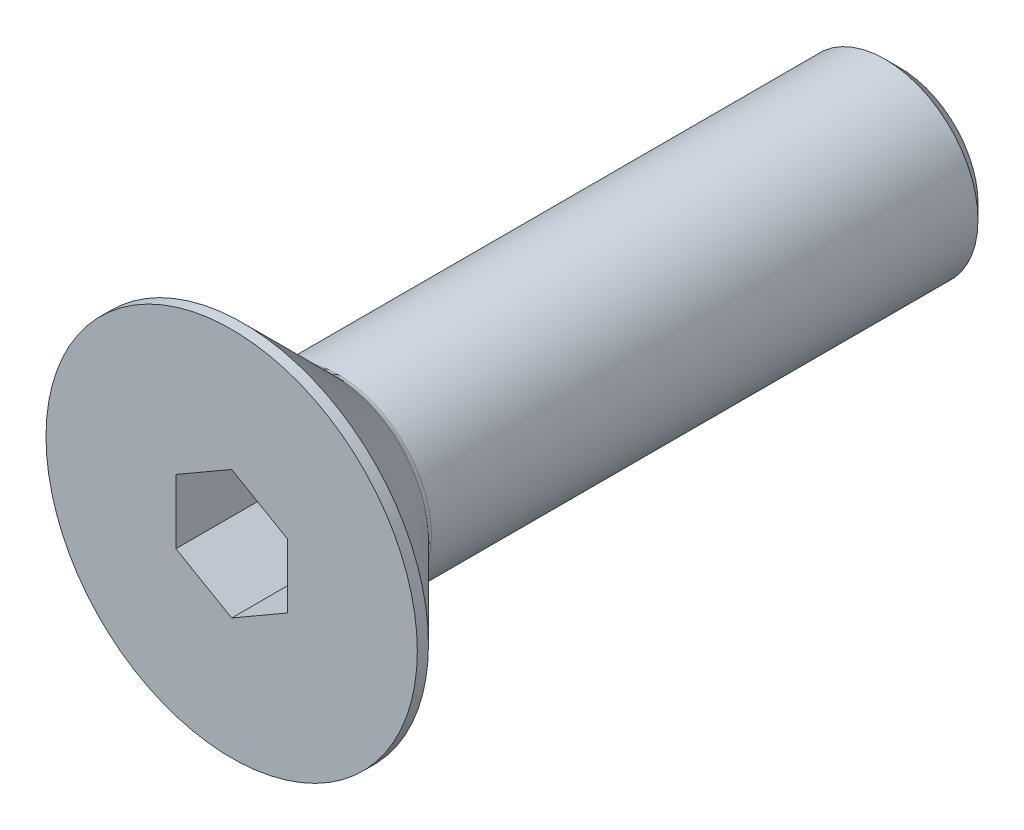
ISO-10303-21;
HEADER;
FILE_DESCRIPTION(('STEP AP214'),'2;1');
FILE_NAME('part.step','',(''),(''),'','','');
FILE_SCHEMA(('AUTOMOTIVE_DESIGN { 1 0 10303 214 1 1 1 1 }'));
ENDSEC;
DATA;
#1=APPLICATION_CONTEXT('core data for automotive mechanical design processes');
#2=APPLICATION_PROTOCOL_DEFINITION('international standard','automotive_design',2000,#1);
#3=PRODUCT_CONTEXT('',#1,'mechanical');
#4=PRODUCT('Part','Part','',(#3));
#5=PRODUCT_RELATED_PRODUCT_CATEGORY('part','',(#4));
#6=PRODUCT_DEFINITION_FORMATION('','',#4);
#7=PRODUCT_DEFINITION_CONTEXT('part definition',#1,'design');
#8=PRODUCT_DEFINITION('design','',#6,#7);
#9=PRODUCT_DEFINITION_SHAPE('','',#8);
#10=(LENGTH_UNIT() NAMED_UNIT(*) SI_UNIT(.MILLI.,.METRE.));
#11=(NAMED_UNIT(*) PLANE_ANGLE_UNIT() SI_UNIT($,.RADIAN.));
#12=(NAMED_UNIT(*) SI_UNIT($,.STERADIAN.) SOLID_ANGLE_UNIT());
#13=UNCERTAINTY_MEASURE_WITH_UNIT(LENGTH_MEASURE(1.E-05),#10,'distance_accuracy_value','');
#14=(GEOMETRIC_REPRESENTATION_CONTEXT(3) GLOBAL_UNCERTAINTY_ASSIGNED_CONTEXT((#13)) GLOBAL_UNIT_ASSIGNED_CONTEXT((#10,
#11,#12)) REPRESENTATION_CONTEXT('',''));
#15=CARTESIAN_POINT('',(0.,0.,0.));
#16=DIRECTION('',(0.,0.,1.));
#17=DIRECTION('',(1.,0.,0.));
#18=AXIS2_PLACEMENT_3D('',#15,#16,#17);
#19=CARTESIAN_POINT('',(0.,1.73205080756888,0.));
#20=DIRECTION('',(-0.5,0.866025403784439,0.));
#21=DIRECTION('',(-0.866025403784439,-0.5,0.));
#22=AXIS2_PLACEMENT_3D('',#19,#20,#21);
#23=PLANE('',#22);
#24=DIRECTION('',(0.,0.,1.));
#25=VECTOR('',#24,1.);
#26=CARTESIAN_POINT('',(0.,1.73205080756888,0.));
#27=LINE('',#26,#25);
#28=CARTESIAN_POINT('',(0.,1.73205080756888,-2.3));
#29=VERTEX_POINT('',#28);
#30=CARTESIAN_POINT('',(0.,1.73205080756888,0.));
#31=VERTEX_POINT('',#30);
#32=EDGE_CURVE('E82',#29,#31,#27,.T.);
#33=ORIENTED_EDGE('',*,*,#32,.T.);
#34=DIRECTION('',(-0.866025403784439,-0.5,0.));
#35=VECTOR('',#34,1.);
#36=CARTESIAN_POINT('',(0.,1.73205080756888,0.));
#37=LINE('',#36,#35);
#38=CARTESIAN_POINT('',(-1.5,0.866025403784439,0.));
#39=VERTEX_POINT('',#38);
#40=EDGE_CURVE('E71',#39,#31,#37,.F.);
#41=ORIENTED_EDGE('',*,*,#40,.F.);
#42=DIRECTION('',(0.,0.,1.));
#43=VECTOR('',#42,1.);
#44=CARTESIAN_POINT('',(-1.5,0.866025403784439,0.));
#45=LINE('',#44,#43);
#46=CARTESIAN_POINT('',(-1.5,0.866025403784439,-2.3));
#47=VERTEX_POINT('',#46);
#48=EDGE_CURVE('E138',#39,#47,#45,.F.);
#49=ORIENTED_EDGE('',*,*,#48,.T.);
#50=DIRECTION('',(-0.866025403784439,-0.5,0.));
#51=VECTOR('',#50,1.);
#52=CARTESIAN_POINT('',(0.,1.73205080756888,-2.3));
#53=LINE('',#52,#51);
#54=EDGE_CURVE('E67',#29,#47,#53,.T.);
#55=ORIENTED_EDGE('',*,*,#54,.F.);
#56=EDGE_LOOP('',(#33,#41,#49,#55));
#57=FACE_BOUND('',#56,.T.);
#58=ADVANCED_FACE('F16',(#57),#23,.F.);
#59=CARTESIAN_POINT('',(1.5,0.86602540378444,0.));
#60=DIRECTION('',(0.499999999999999,0.866025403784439,0.));
#61=DIRECTION('',(-0.866025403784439,0.499999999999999,0.));
#62=AXIS2_PLACEMENT_3D('',#59,#60,#61);
#63=PLANE('',#62);
#64=DIRECTION('',(0.,0.,-1.));
#65=VECTOR('',#64,1.);
#66=CARTESIAN_POINT('',(1.5,0.86602540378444,0.));
#67=LINE('',#66,#65);
#68=CARTESIAN_POINT('',(1.5,0.86602540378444,-2.3));
#69=VERTEX_POINT('',#68);
#70=CARTESIAN_POINT('',(1.5,0.86602540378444,0.));
#71=VERTEX_POINT('',#70);
#72=EDGE_CURVE('E87',#69,#71,#67,.F.);
#73=ORIENTED_EDGE('',*,*,#72,.T.);
#74=DIRECTION('',(-0.866025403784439,0.499999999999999,0.));
#75=VECTOR('',#74,1.);
#76=CARTESIAN_POINT('',(1.5,0.86602540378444,0.));
#77=LINE('',#76,#75);
#78=EDGE_CURVE('E75',#31,#71,#77,.F.);
#79=ORIENTED_EDGE('',*,*,#78,.F.);
#80=ORIENTED_EDGE('',*,*,#32,.F.);
#81=DIRECTION('',(-0.866025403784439,0.499999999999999,0.));
#82=VECTOR('',#81,1.);
#83=CARTESIAN_POINT('',(1.5,0.86602540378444,-2.3));
#84=LINE('',#83,#82);
#85=EDGE_CURVE('E88',#69,#29,#84,.T.);
#86=ORIENTED_EDGE('',*,*,#85,.F.);
#87=EDGE_LOOP('',(#73,#79,#80,#86));
#88=FACE_BOUND('',#87,.T.);
#89=ADVANCED_FACE('F85',(#88),#63,.F.);
#90=CARTESIAN_POINT('',(-1.5,0.866025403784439,0.));
#91=DIRECTION('',(-1.,0.,0.));
#92=DIRECTION('',(0.,0.,1.));
#93=AXIS2_PLACEMENT_3D('',#90,#91,#92);
#94=PLANE('',#93);
#95=ORIENTED_EDGE('',*,*,#48,.F.);
#96=DIRECTION('',(0.,1.,0.));
#97=VECTOR('',#96,1.);
#98=CARTESIAN_POINT('',(-1.5,0.866025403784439,0.));
#99=LINE('',#98,#97);
#100=CARTESIAN_POINT('',(-1.5,-0.866025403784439,0.));
#101=VERTEX_POINT('',#100);
#102=EDGE_CURVE('E78',#101,#39,#99,.T.);
#103=ORIENTED_EDGE('',*,*,#102,.F.);
#104=DIRECTION('',(0.,0.,1.));
#105=VECTOR('',#104,1.);
#106=CARTESIAN_POINT('',(-1.5,-0.866025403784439,0.));
#107=LINE('',#106,#105);
#108=CARTESIAN_POINT('',(-1.5,-0.866025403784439,-2.3));
#109=VERTEX_POINT('',#108);
#110=EDGE_CURVE('E129',#101,#109,#107,.F.);
#111=ORIENTED_EDGE('',*,*,#110,.T.);
#112=DIRECTION('',(0.,1.,0.));
#113=VECTOR('',#112,1.);
#114=CARTESIAN_POINT('',(-1.5,0.866025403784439,-2.3));
#115=LINE('',#114,#113);
#116=EDGE_CURVE('E136',#47,#109,#115,.F.);
#117=ORIENTED_EDGE('',*,*,#116,.F.);
#118=EDGE_LOOP('',(#95,#103,#111,#117));
#119=FACE_BOUND('',#118,.T.);
#120=ADVANCED_FACE('F141',(#119),#94,.F.);
#121=CARTESIAN_POINT('',(1.5,-0.866025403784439,0.));
#122=DIRECTION('',(1.,0.,0.));
#123=DIRECTION('',(0.,0.,-1.));
#124=AXIS2_PLACEMENT_3D('',#121,#122,#123);
#125=PLANE('',#124);
#126=DIRECTION('',(0.,0.,1.));
#127=VECTOR('',#126,1.);
#128=CARTESIAN_POINT('',(1.5,-0.866025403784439,0.));
#129=LINE('',#128,#127);
#130=CARTESIAN_POINT('',(1.5,-0.866025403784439,-2.3));
#131=VERTEX_POINT('',#130);
#132=CARTESIAN_POINT('',(1.5,-0.866025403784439,0.));
#133=VERTEX_POINT('',#132);
#134=EDGE_CURVE('E121',#131,#133,#129,.T.);
#135=ORIENTED_EDGE('',*,*,#134,.T.);
#136=DIRECTION('',(0.,1.,0.));
#137=VECTOR('',#136,1.);
#138=CARTESIAN_POINT('',(1.5,-0.866025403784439,0.));
#139=LINE('',#138,#137);
#140=EDGE_CURVE('E35',#71,#133,#139,.F.);
#141=ORIENTED_EDGE('',*,*,#140,.F.);
#142=ORIENTED_EDGE('',*,*,#72,.F.);
#143=DIRECTION('',(0.,1.,0.));
#144=VECTOR('',#143,1.);
#145=CARTESIAN_POINT('',(1.5,0.,-2.3));
#146=LINE('',#145,#144);
#147=EDGE_CURVE('E123',#131,#69,#146,.T.);
#148=ORIENTED_EDGE('',*,*,#147,.F.);
#149=EDGE_LOOP('',(#135,#141,#142,#148));
#150=FACE_BOUND('',#149,.T.);
#151=ADVANCED_FACE('F148',(#150),#125,.F.);
#152=CARTESIAN_POINT('',(-1.5,-0.866025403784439,0.));
#153=DIRECTION('',(-0.499999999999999,-0.866025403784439,0.));
#154=DIRECTION('',(0.866025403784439,-0.499999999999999,0.));
#155=AXIS2_PLACEMENT_3D('',#152,#153,#154);
#156=PLANE('',#155);
#157=ORIENTED_EDGE('',*,*,#110,.F.);
#158=DIRECTION('',(0.866025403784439,-0.499999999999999,0.));
#159=VECTOR('',#158,1.);
#160=CARTESIAN_POINT('',(-1.5,-0.866025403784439,0.));
#161=LINE('',#160,#159);
#162=CARTESIAN_POINT('',(0.,-1.73205080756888,0.));
#163=VERTEX_POINT('',#162);
#164=EDGE_CURVE('E132',#163,#101,#161,.F.);
#165=ORIENTED_EDGE('',*,*,#164,.F.);
#166=DIRECTION('',(0.,0.,1.));
#167=VECTOR('',#166,1.);
#168=CARTESIAN_POINT('',(0.,-1.73205080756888,0.));
#169=LINE('',#168,#167);
#170=CARTESIAN_POINT('',(0.,-1.73205080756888,-2.3));
#171=VERTEX_POINT('',#170);
#172=EDGE_CURVE('E119',#163,#171,#169,.F.);
#173=ORIENTED_EDGE('',*,*,#172,.T.);
#174=DIRECTION('',(0.866025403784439,-0.5,0.));
#175=VECTOR('',#174,1.);
#176=CARTESIAN_POINT('',(-1.5,-0.866025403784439,-2.3));
#177=LINE('',#176,#175);
#178=EDGE_CURVE('E126',#109,#171,#177,.T.);
#179=ORIENTED_EDGE('',*,*,#178,.F.);
#180=EDGE_LOOP('',(#157,#165,#173,#179));
#181=FACE_BOUND('',#180,.T.);
#182=ADVANCED_FACE('F155',(#181),#156,.F.);
#183=CARTESIAN_POINT('',(0.,0.,-2.3));
#184=DIRECTION('',(0.,0.,1.));
#185=DIRECTION('',(1.,0.,0.));
#186=AXIS2_PLACEMENT_3D('',#183,#184,#185);
#187=PLANE('',#186);
#188=ORIENTED_EDGE('',*,*,#54,.T.);
#189=ORIENTED_EDGE('',*,*,#116,.T.);
#190=ORIENTED_EDGE('',*,*,#178,.T.);
#191=DIRECTION('',(0.866025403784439,0.5,0.));
#192=VECTOR('',#191,1.);
#193=CARTESIAN_POINT('',(0.,-1.73205080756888,-2.3));
#194=LINE('',#193,#192);
#195=EDGE_CURVE('E116',#171,#131,#194,.T.);
#196=ORIENTED_EDGE('',*,*,#195,.T.);
#197=ORIENTED_EDGE('',*,*,#147,.T.);
#198=ORIENTED_EDGE('',*,*,#85,.T.);
#199=EDGE_LOOP('',(#188,#189,#190,#196,#197,#198));
#200=FACE_BOUND('',#199,.T.);
#201=ADVANCED_FACE('F145',(#200),#187,.T.);
#202=CARTESIAN_POINT('',(0.,-1.73205080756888,0.));
#203=DIRECTION('',(0.5,-0.866025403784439,0.));
#204=DIRECTION('',(0.866025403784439,0.5,0.));
#205=AXIS2_PLACEMENT_3D('',#202,#203,#204);
#206=PLANE('',#205);
#207=ORIENTED_EDGE('',*,*,#172,.F.);
#208=DIRECTION('',(-0.866025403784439,-0.5,0.));
#209=VECTOR('',#208,1.);
#210=CARTESIAN_POINT('',(1.5,-0.866025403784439,0.));
#211=LINE('',#210,#209);
#212=EDGE_CURVE('E114',#133,#163,#211,.T.);
#213=ORIENTED_EDGE('',*,*,#212,.F.);
#214=ORIENTED_EDGE('',*,*,#134,.F.);
#215=ORIENTED_EDGE('',*,*,#195,.F.);
#216=EDGE_LOOP('',(#207,#213,#214,#215));
#217=FACE_BOUND('',#216,.T.);
#218=ADVANCED_FACE('F153',(#217),#206,.F.);
#219=CARTESIAN_POINT('',(2.5,0.,0.));
#220=DIRECTION('',(0.,0.,1.));
#221=DIRECTION('',(1.,0.,0.));
#222=AXIS2_PLACEMENT_3D('',#219,#220,#221);
#223=PLANE('',#222);
#224=ORIENTED_EDGE('',*,*,#140,.T.);
#225=ORIENTED_EDGE('',*,*,#212,.T.);
#226=ORIENTED_EDGE('',*,*,#164,.T.);
#227=ORIENTED_EDGE('',*,*,#102,.T.);
#228=ORIENTED_EDGE('',*,*,#40,.T.);
#229=ORIENTED_EDGE('',*,*,#78,.T.);
#230=EDGE_LOOP('',(#224,#225,#226,#227,#228,#229));
#231=FACE_BOUND('',#230,.T.);
#232=CARTESIAN_POINT('',(0.,0.,0.));
#233=DIRECTION('',(0.,0.,-1.));
#234=DIRECTION('',(-1.,0.,0.));
#235=AXIS2_PLACEMENT_3D('',#232,#233,#234);
#236=CIRCLE('',#235,5.);
#237=CARTESIAN_POINT('',(-5.,0.,0.));
#238=VERTEX_POINT('',#237);
#239=EDGE_CURVE('E20',#238,#238,#236,.T.);
#240=ORIENTED_EDGE('',*,*,#239,.F.);
#241=EDGE_LOOP('',(#240));
#242=FACE_BOUND('',#241,.T.);
#243=ADVANCED_FACE('F72',(#231,#242),#223,.T.);
#244=CARTESIAN_POINT('',(0.,0.,-0.150000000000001));
#245=DIRECTION('',(0.,0.,-1.));
#246=DIRECTION('',(-1.,0.,0.));
#247=AXIS2_PLACEMENT_3D('',#244,#245,#246);
#248=CYLINDRICAL_SURFACE('',#247,5.);
#249=ORIENTED_EDGE('',*,*,#239,.T.);
#250=EDGE_LOOP('',(#249));
#251=FACE_BOUND('',#250,.T.);
#252=CARTESIAN_POINT('',(0.,0.,-0.299999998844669));
#253=DIRECTION('',(0.,0.,1.));
#254=DIRECTION('',(1.,0.,0.));
#255=AXIS2_PLACEMENT_3D('',#252,#253,#254);
#256=CIRCLE('',#255,4.99999999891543);
#257=CARTESIAN_POINT('',(4.99999999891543,0.,-0.299999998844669));
#258=VERTEX_POINT('',#257);
#259=EDGE_CURVE('E101',#258,#258,#256,.F.);
#260=ORIENTED_EDGE('',*,*,#259,.F.);
#261=EDGE_LOOP('',(#260));
#262=FACE_BOUND('',#261,.T.);
#263=ADVANCED_FACE('F184',(#251,#262),#248,.T.);
#264=CARTESIAN_POINT('',(0.,0.,-0.299999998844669));
#265=DIRECTION('',(0.,0.,1.));
#266=DIRECTION('',(1.,0.,0.));
#267=AXIS2_PLACEMENT_3D('',#264,#265,#266);
#268=CONICAL_SURFACE('',#267,4.99999999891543,0.785398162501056);
#269=CARTESIAN_POINT('',(0.,0.,-2.74142135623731));
#270=DIRECTION('',(0.,0.,-1.));
#271=DIRECTION('',(-1.,0.,0.));
#272=AXIS2_PLACEMENT_3D('',#269,#270,#271);
#273=CIRCLE('',#272,2.55857864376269);
#274=CARTESIAN_POINT('',(-2.55857864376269,0.,-2.74142135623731));
#275=VERTEX_POINT('',#274);
#276=EDGE_CURVE('E95',#275,#275,#273,.T.);
#277=ORIENTED_EDGE('',*,*,#276,.F.);
#278=EDGE_LOOP('',(#277));
#279=FACE_BOUND('',#278,.T.);
#280=ORIENTED_EDGE('',*,*,#259,.T.);
#281=EDGE_LOOP('',(#280));
#282=FACE_BOUND('',#281,.T.);
#283=ADVANCED_FACE('F180',(#279,#282),#268,.T.);
#284=CARTESIAN_POINT('',(1.25,0.,-18.));
#285=DIRECTION('',(0.,0.,-1.));
#286=DIRECTION('',(-1.,0.,0.));
#287=AXIS2_PLACEMENT_3D('',#284,#285,#286);
#288=PLANE('',#287);
#289=CARTESIAN_POINT('',(0.,0.,-18.0000000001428));
#290=DIRECTION('',(0.,0.,1.));
#291=DIRECTION('',(1.,0.,0.));
#292=AXIS2_PLACEMENT_3D('',#289,#290,#291);
#293=CIRCLE('',#292,2.10000000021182);
#294=CARTESIAN_POINT('',(2.10000000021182,0.,-18.0000000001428));
#295=VERTEX_POINT('',#294);
#296=EDGE_CURVE('E93',#295,#295,#293,.T.);
#297=ORIENTED_EDGE('',*,*,#296,.F.);
#298=EDGE_LOOP('',(#297));
#299=FACE_BOUND('',#298,.T.);
#300=ADVANCED_FACE('F177',(#299),#288,.T.);
#301=CARTESIAN_POINT('',(0.,0.,-2.88284271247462));
#302=DIRECTION('',(0.,0.,-1.));
#303=DIRECTION('',(0.,1.,0.));
#304=AXIS2_PLACEMENT_3D('',#301,#302,#303);
#305=TOROIDAL_SURFACE('',#304,2.7,0.2);
#306=CARTESIAN_POINT('',(0.,0.,-2.88284271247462));
#307=DIRECTION('',(0.,0.,-1.));
#308=DIRECTION('',(-1.,0.,0.));
#309=AXIS2_PLACEMENT_3D('',#306,#307,#308);
#310=CIRCLE('',#309,2.5);
#311=CARTESIAN_POINT('',(-2.5,0.,-2.88284271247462));
#312=VERTEX_POINT('',#311);
#313=EDGE_CURVE('E26',#312,#312,#310,.T.);
#314=ORIENTED_EDGE('',*,*,#313,.F.);
#315=EDGE_LOOP('',(#314));
#316=FACE_BOUND('',#315,.T.);
#317=ORIENTED_EDGE('',*,*,#276,.T.);
#318=EDGE_LOOP('',(#317));
#319=FACE_BOUND('',#318,.T.);
#320=ADVANCED_FACE('F18',(#316,#319),#305,.F.);
#321=CARTESIAN_POINT('',(0.,0.,-17.5999999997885));
#322=DIRECTION('',(0.,0.,1.));
#323=DIRECTION('',(1.,0.,0.));
#324=AXIS2_PLACEMENT_3D('',#321,#322,#323);
#325=CONICAL_SURFACE('',#324,2.4999999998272,0.785398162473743);
#326=ORIENTED_EDGE('',*,*,#296,.T.);
#327=EDGE_LOOP('',(#326));
#328=FACE_BOUND('',#327,.T.);
#329=CARTESIAN_POINT('',(0.,0.,-17.6));
#330=DIRECTION('',(0.,0.,-1.));
#331=DIRECTION('',(-1.,0.,0.));
#332=AXIS2_PLACEMENT_3D('',#329,#330,#331);
#333=CIRCLE('',#332,2.5);
#334=CARTESIAN_POINT('',(-2.5,0.,-17.6));
#335=VERTEX_POINT('',#334);
#336=EDGE_CURVE('E11',#335,#335,#333,.F.);
#337=ORIENTED_EDGE('',*,*,#336,.F.);
#338=EDGE_LOOP('',(#337));
#339=FACE_BOUND('',#338,.T.);
#340=ADVANCED_FACE('F167',(#328,#339),#325,.T.);
#341=CARTESIAN_POINT('',(0.,0.,-10.4));
#342=DIRECTION('',(0.,0.,-1.));
#343=DIRECTION('',(-1.,0.,0.));
#344=AXIS2_PLACEMENT_3D('',#341,#342,#343);
#345=CYLINDRICAL_SURFACE('',#344,2.5);
#346=ORIENTED_EDGE('',*,*,#336,.T.);
#347=EDGE_LOOP('',(#346));
#348=FACE_BOUND('',#347,.T.);
#349=ORIENTED_EDGE('',*,*,#313,.T.);
#350=EDGE_LOOP('',(#349));
#351=FACE_BOUND('',#350,.T.);
#352=ADVANCED_FACE('F165',(#348,#351),#345,.T.);
#353=CLOSED_SHELL('',(#58,#89,#120,#151,#182,#201,#218,#243,#263,#283,#300,#320,#340,#352));
#354=MANIFOLD_SOLID_BREP('B1',#353);
#355=ADVANCED_BREP_SHAPE_REPRESENTATION('',(#18,#354),#14);
#356=SHAPE_DEFINITION_REPRESENTATION(#9,#355);
ENDSEC;
END-ISO-10303-21;
